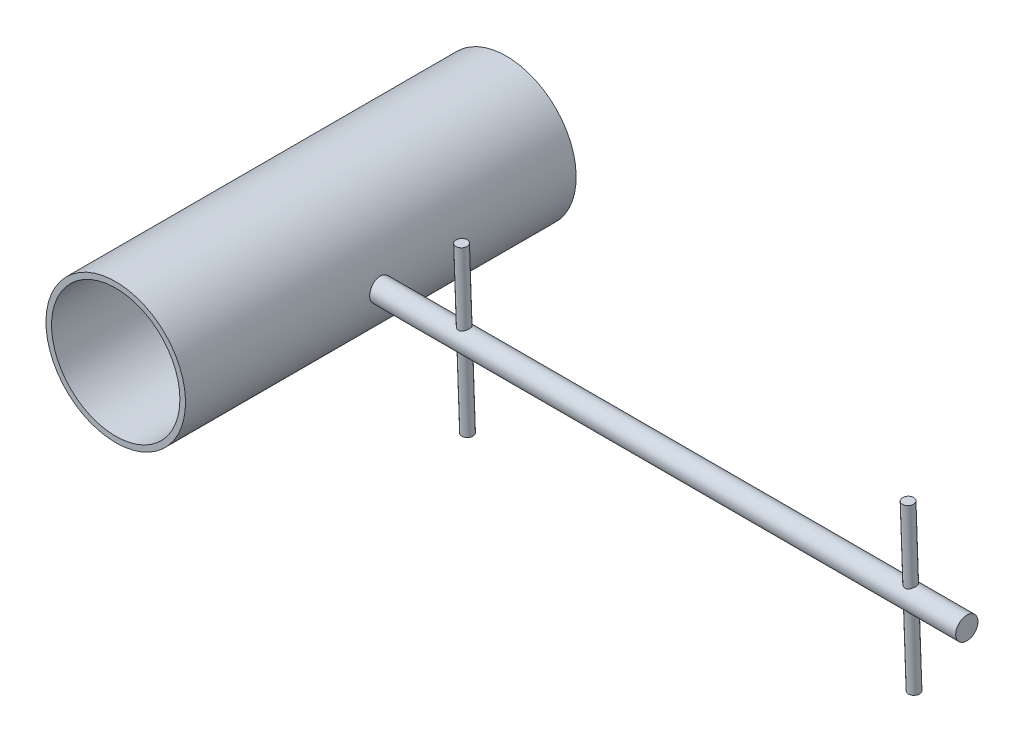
ISO-10303-21;
HEADER;
FILE_DESCRIPTION(('STEP AP214'),'2;1');
FILE_NAME('part.step','',(''),(''),'','','');
FILE_SCHEMA(('AUTOMOTIVE_DESIGN { 1 0 10303 214 1 1 1 1 }'));
ENDSEC;
DATA;
#1=APPLICATION_CONTEXT('core data for automotive mechanical design processes');
#2=APPLICATION_PROTOCOL_DEFINITION('international standard','automotive_design',2000,#1);
#3=PRODUCT_CONTEXT('',#1,'mechanical');
#4=PRODUCT('Part','Part','',(#3));
#5=PRODUCT_RELATED_PRODUCT_CATEGORY('part','',(#4));
#6=PRODUCT_DEFINITION_FORMATION('','',#4);
#7=PRODUCT_DEFINITION_CONTEXT('part definition',#1,'design');
#8=PRODUCT_DEFINITION('design','',#6,#7);
#9=PRODUCT_DEFINITION_SHAPE('','',#8);
#10=(LENGTH_UNIT() NAMED_UNIT(*) SI_UNIT(.MILLI.,.METRE.));
#11=(NAMED_UNIT(*) PLANE_ANGLE_UNIT() SI_UNIT($,.RADIAN.));
#12=(NAMED_UNIT(*) SI_UNIT($,.STERADIAN.) SOLID_ANGLE_UNIT());
#13=UNCERTAINTY_MEASURE_WITH_UNIT(LENGTH_MEASURE(1.E-05),#10,'distance_accuracy_value','');
#14=(GEOMETRIC_REPRESENTATION_CONTEXT(3) GLOBAL_UNCERTAINTY_ASSIGNED_CONTEXT((#13)) GLOBAL_UNIT_ASSIGNED_CONTEXT((#10,
#11,#12)) REPRESENTATION_CONTEXT('',''));
#15=CARTESIAN_POINT('',(0.,0.,0.));
#16=DIRECTION('',(0.,0.,1.));
#17=DIRECTION('',(1.,0.,0.));
#18=AXIS2_PLACEMENT_3D('',#15,#16,#17);
#19=CARTESIAN_POINT('',(0.,0.,-35.));
#20=DIRECTION('',(0.,0.,1.));
#21=DIRECTION('',(1.,0.,0.));
#22=AXIS2_PLACEMENT_3D('',#19,#20,#21);
#23=CYLINDRICAL_SURFACE('',#22,11.5);
#24=CARTESIAN_POINT('',(0.,0.,35.));
#25=DIRECTION('',(0.,0.,1.));
#26=DIRECTION('',(1.,0.,0.));
#27=AXIS2_PLACEMENT_3D('',#24,#25,#26);
#28=CIRCLE('',#27,11.5);
#29=CARTESIAN_POINT('',(11.5,0.,35.));
#30=VERTEX_POINT('',#29);
#31=EDGE_CURVE('E179',#30,#30,#28,.F.);
#32=ORIENTED_EDGE('',*,*,#31,.F.);
#33=EDGE_LOOP('',(#32));
#34=FACE_BOUND('',#33,.T.);
#35=CARTESIAN_POINT('',(0.,0.,-35.));
#36=DIRECTION('',(0.,0.,1.));
#37=DIRECTION('',(1.,0.,0.));
#38=AXIS2_PLACEMENT_3D('',#35,#36,#37);
#39=CIRCLE('',#38,11.5);
#40=CARTESIAN_POINT('',(11.5,0.,-35.));
#41=VERTEX_POINT('',#40);
#42=EDGE_CURVE('E20',#41,#41,#39,.T.);
#43=ORIENTED_EDGE('',*,*,#42,.F.);
#44=EDGE_LOOP('',(#43));
#45=FACE_BOUND('',#44,.T.);
#46=ADVANCED_FACE('F15',(#34,#45),#23,.F.);
#47=CARTESIAN_POINT('',(106.4,15.0296588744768,-0.565114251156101));
#48=DIRECTION('',(0.,0.999365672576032,0.035612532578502));
#49=DIRECTION('',(0.,-0.035612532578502,0.999365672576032));
#50=AXIS2_PLACEMENT_3D('',#47,#48,#49);
#51=PLANE('',#50);
#52=CARTESIAN_POINT('',(107.5,14.9904850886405,0.534187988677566));
#53=DIRECTION('',(0.,0.999365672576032,0.0356125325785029));
#54=DIRECTION('',(0.,-0.0356125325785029,0.999365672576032));
#55=AXIS2_PLACEMENT_3D('',#52,#53,#54);
#56=CIRCLE('',#55,1.00000000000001);
#57=CARTESIAN_POINT('',(107.5,14.954872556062,1.53355366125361));
#58=VERTEX_POINT('',#57);
#59=EDGE_CURVE('E182',#58,#58,#56,.F.);
#60=ORIENTED_EDGE('',*,*,#59,.F.);
#61=EDGE_LOOP('',(#60));
#62=FACE_BOUND('',#61,.T.);
#63=ADVANCED_FACE('F158',(#62),#51,.T.);
#64=CARTESIAN_POINT('',(26.4,15.0296588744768,-0.565114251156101));
#65=DIRECTION('',(0.,0.999365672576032,0.035612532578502));
#66=DIRECTION('',(0.,-0.035612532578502,0.999365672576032));
#67=AXIS2_PLACEMENT_3D('',#64,#65,#66);
#68=PLANE('',#67);
#69=CARTESIAN_POINT('',(27.5,14.9904850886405,0.534187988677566));
#70=DIRECTION('',(0.,0.999365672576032,0.0356125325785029));
#71=DIRECTION('',(0.,-0.0356125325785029,0.999365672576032));
#72=AXIS2_PLACEMENT_3D('',#69,#70,#71);
#73=CIRCLE('',#72,1.00000000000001);
#74=CARTESIAN_POINT('',(27.5,14.954872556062,1.53355366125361));
#75=VERTEX_POINT('',#74);
#76=EDGE_CURVE('E184',#75,#75,#73,.F.);
#77=ORIENTED_EDGE('',*,*,#76,.F.);
#78=EDGE_LOOP('',(#77));
#79=FACE_BOUND('',#78,.T.);
#80=ADVANCED_FACE('F150',(#79),#68,.T.);
#81=CARTESIAN_POINT('',(26.4,-15.0296588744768,0.56511425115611));
#82=DIRECTION('',(0.,-0.999365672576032,-0.035612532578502));
#83=DIRECTION('',(0.,0.035612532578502,-0.999365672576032));
#84=AXIS2_PLACEMENT_3D('',#81,#82,#83);
#85=PLANE('',#84);
#86=CARTESIAN_POINT('',(27.5,-14.9904850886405,-0.534187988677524));
#87=DIRECTION('',(0.,0.999365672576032,0.0356125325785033));
#88=DIRECTION('',(0.,-0.0356125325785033,0.999365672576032));
#89=AXIS2_PLACEMENT_3D('',#86,#87,#88);
#90=CIRCLE('',#89,1.00000000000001);
#91=CARTESIAN_POINT('',(27.5,-15.026097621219,0.465177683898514));
#92=VERTEX_POINT('',#91);
#93=EDGE_CURVE('E189',#92,#92,#90,.T.);
#94=ORIENTED_EDGE('',*,*,#93,.F.);
#95=EDGE_LOOP('',(#94));
#96=FACE_BOUND('',#95,.T.);
#97=ADVANCED_FACE('F142',(#96),#85,.T.);
#98=CARTESIAN_POINT('',(13.75,-13.75,-35.));
#99=DIRECTION('',(0.,0.,-1.));
#100=DIRECTION('',(-1.,0.,0.));
#101=AXIS2_PLACEMENT_3D('',#98,#99,#100);
#102=PLANE('',#101);
#103=ORIENTED_EDGE('',*,*,#42,.T.);
#104=EDGE_LOOP('',(#103));
#105=FACE_BOUND('',#104,.T.);
#106=CARTESIAN_POINT('',(0.,0.,-35.));
#107=DIRECTION('',(0.,0.,1.));
#108=DIRECTION('',(0.,-1.,0.));
#109=AXIS2_PLACEMENT_3D('',#106,#107,#108);
#110=CIRCLE('',#109,12.5);
#111=CARTESIAN_POINT('',(0.,-12.5,-35.));
#112=VERTEX_POINT('',#111);
#113=EDGE_CURVE('E192',#112,#112,#110,.T.);
#114=ORIENTED_EDGE('',*,*,#113,.F.);
#115=EDGE_LOOP('',(#114));
#116=FACE_BOUND('',#115,.T.);
#117=ADVANCED_FACE('F134',(#105,#116),#102,.T.);
#118=CARTESIAN_POINT('',(-13.75,-13.75,35.));
#119=DIRECTION('',(0.,0.,1.));
#120=DIRECTION('',(1.,0.,0.));
#121=AXIS2_PLACEMENT_3D('',#118,#119,#120);
#122=PLANE('',#121);
#123=ORIENTED_EDGE('',*,*,#31,.T.);
#124=EDGE_LOOP('',(#123));
#125=FACE_BOUND('',#124,.T.);
#126=CARTESIAN_POINT('',(0.,0.,35.));
#127=DIRECTION('',(0.,0.,1.));
#128=DIRECTION('',(0.,-1.,0.));
#129=AXIS2_PLACEMENT_3D('',#126,#127,#128);
#130=CIRCLE('',#129,12.5);
#131=CARTESIAN_POINT('',(0.,-12.5,35.));
#132=VERTEX_POINT('',#131);
#133=EDGE_CURVE('E195',#132,#132,#130,.F.);
#134=ORIENTED_EDGE('',*,*,#133,.F.);
#135=EDGE_LOOP('',(#134));
#136=FACE_BOUND('',#135,.T.);
#137=ADVANCED_FACE('F126',(#125,#136),#122,.T.);
#138=CARTESIAN_POINT('',(117.5,-2.2,2.2));
#139=DIRECTION('',(1.,0.,0.));
#140=DIRECTION('',(0.,0.,-1.));
#141=AXIS2_PLACEMENT_3D('',#138,#139,#140);
#142=PLANE('',#141);
#143=CARTESIAN_POINT('',(117.5,0.,0.));
#144=DIRECTION('',(-1.,0.,0.));
#145=DIRECTION('',(0.,0.,1.));
#146=AXIS2_PLACEMENT_3D('',#143,#144,#145);
#147=CIRCLE('',#146,2.);
#148=CARTESIAN_POINT('',(117.5,0.,2.00000000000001));
#149=VERTEX_POINT('',#148);
#150=EDGE_CURVE('E196',#149,#149,#147,.T.);
#151=ORIENTED_EDGE('',*,*,#150,.F.);
#152=EDGE_LOOP('',(#151));
#153=FACE_BOUND('',#152,.T.);
#154=ADVANCED_FACE('F119',(#153),#142,.T.);
#155=CARTESIAN_POINT('',(107.5,14.9904850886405,0.534187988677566));
#156=DIRECTION('',(0.,0.999365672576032,0.0356125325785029));
#157=DIRECTION('',(0.,-0.0356125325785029,0.999365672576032));
#158=AXIS2_PLACEMENT_3D('',#155,#156,#157);
#159=CYLINDRICAL_SURFACE('',#158,1.00000000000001);
#160=CARTESIAN_POINT('',(107.5,1.76656465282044,-0.93768295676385));
#161=CARTESIAN_POINT('',(107.552107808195,1.76656906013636,-0.93767916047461));
#162=CARTESIAN_POINT('',(107.604281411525,1.76880433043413,-0.933500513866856));
#163=CARTESIAN_POINT('',(107.707027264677,1.77740806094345,-0.917006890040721));
#164=CARTESIAN_POINT('',(107.757595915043,1.78378520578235,-0.904674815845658));
#165=CARTESIAN_POINT('',(107.855451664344,1.79970918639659,-0.872561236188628));
#166=CARTESIAN_POINT('',(107.902754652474,1.80923914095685,-0.852819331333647));
#167=CARTESIAN_POINT('',(107.993424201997,1.83031263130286,-0.806597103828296));
#168=CARTESIAN_POINT('',(108.036790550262,1.84185627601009,-0.780116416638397));
#169=CARTESIAN_POINT('',(108.122305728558,1.86674551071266,-0.718642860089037));
#170=CARTESIAN_POINT('',(108.164059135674,1.88016119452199,-0.683128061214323));
#171=CARTESIAN_POINT('',(108.241408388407,1.90650120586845,-0.60574271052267));
#172=CARTESIAN_POINT('',(108.277001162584,1.91942528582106,-0.563869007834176));
#173=CARTESIAN_POINT('',(108.343367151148,1.94424112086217,-0.471549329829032));
#174=CARTESIAN_POINT('',(108.37365376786,1.95600456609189,-0.420715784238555));
#175=CARTESIAN_POINT('',(108.425140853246,1.97594285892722,-0.313987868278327));
#176=CARTESIAN_POINT('',(108.446347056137,1.98411997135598,-0.258096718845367));
#177=CARTESIAN_POINT('',(108.477504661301,1.99530819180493,-0.14708026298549));
#178=CARTESIAN_POINT('',(108.488149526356,1.9986454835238,-0.0921834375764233));
#179=CARTESIAN_POINT('',(108.500166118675,2.0006793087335,0.0186904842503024));
#180=CARTESIAN_POINT('',(108.501543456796,1.99937865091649,0.0746669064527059));
#181=CARTESIAN_POINT('',(108.49525332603,1.99245125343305,0.180903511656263));
#182=CARTESIAN_POINT('',(108.488361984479,1.98721054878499,0.231237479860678));
#183=CARTESIAN_POINT('',(108.467119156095,1.97324929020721,0.329795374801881));
#184=CARTESIAN_POINT('',(108.452767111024,1.96452847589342,0.378019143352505));
#185=CARTESIAN_POINT('',(108.41691743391,1.94414547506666,0.471844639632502));
#186=CARTESIAN_POINT('',(108.395323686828,1.93244426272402,0.517400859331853));
#187=CARTESIAN_POINT('',(108.345736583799,1.90706638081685,0.604275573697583));
#188=CARTESIAN_POINT('',(108.317740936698,1.89338900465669,0.645592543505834));
#189=CARTESIAN_POINT('',(108.253104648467,1.86373559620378,0.727007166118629));
#190=CARTESIAN_POINT('',(108.215896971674,1.84766449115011,0.766620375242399));
#191=CARTESIAN_POINT('',(108.13541027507,1.81580554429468,0.839302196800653));
#192=CARTESIAN_POINT('',(108.092126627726,1.80001792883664,0.872365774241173));
#193=CARTESIAN_POINT('',(107.997351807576,1.76933357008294,0.933107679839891));
#194=CARTESIAN_POINT('',(107.945513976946,1.75455706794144,0.960310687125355));
#195=CARTESIAN_POINT('',(107.837062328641,1.7290417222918,1.00553250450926));
#196=CARTESIAN_POINT('',(107.780453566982,1.71829866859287,1.02356089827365));
#197=CARTESIAN_POINT('',(107.668785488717,1.70318699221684,1.04850010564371));
#198=CARTESIAN_POINT('',(107.613958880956,1.69838068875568,1.05617872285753));
#199=CARTESIAN_POINT('',(107.503598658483,1.69441450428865,1.06253333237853));
#200=CARTESIAN_POINT('',(107.44806557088,1.6952506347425,1.06121568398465));
#201=CARTESIAN_POINT('',(107.344346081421,1.70201860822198,1.05031548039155));
#202=CARTESIAN_POINT('',(107.296020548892,1.70738302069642,1.04165279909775));
#203=CARTESIAN_POINT('',(107.201632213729,1.7217909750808,1.0176591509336));
#204=CARTESIAN_POINT('',(107.155570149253,1.73083570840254,1.0023260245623));
#205=CARTESIAN_POINT('',(107.064588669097,1.75211976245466,0.964656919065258));
#206=CARTESIAN_POINT('',(107.019820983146,1.76448763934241,0.942029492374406));
#207=CARTESIAN_POINT('',(106.934530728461,1.79097955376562,0.89063333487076));
#208=CARTESIAN_POINT('',(106.894010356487,1.80510449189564,0.861861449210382));
#209=CARTESIAN_POINT('',(106.813021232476,1.83574257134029,0.794716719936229));
#210=CARTESIAN_POINT('',(106.773202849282,1.85233231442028,0.755590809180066));
#211=CARTESIAN_POINT('',(106.700587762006,1.88464370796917,0.670947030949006));
#212=CARTESIAN_POINT('',(106.667793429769,1.90036506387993,0.625427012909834));
#213=CARTESIAN_POINT('',(106.60942627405,1.92984871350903,0.527596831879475));
#214=CARTESIAN_POINT('',(106.584066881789,1.94354835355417,0.475139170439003));
#215=CARTESIAN_POINT('',(106.542862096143,1.96705402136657,0.365806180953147));
#216=CARTESIAN_POINT('',(106.527008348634,1.97686346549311,0.30893478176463));
#217=CARTESIAN_POINT('',(106.506631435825,1.99088646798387,0.198005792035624));
#218=CARTESIAN_POINT('',(106.501202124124,1.995530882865,0.144168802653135));
#219=CARTESIAN_POINT('',(106.499156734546,2.00040330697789,0.0361363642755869));
#220=CARTESIAN_POINT('',(106.502537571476,2.00063286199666,-0.0180589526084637));
#221=CARTESIAN_POINT('',(106.517416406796,1.99693329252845,-0.121499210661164));
#222=CARTESIAN_POINT('',(106.528364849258,1.99327720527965,-0.170835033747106));
#223=CARTESIAN_POINT('',(106.557326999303,1.98268739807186,-0.267006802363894));
#224=CARTESIAN_POINT('',(106.575341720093,1.97575320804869,-0.313842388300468));
#225=CARTESIAN_POINT('',(106.618727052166,1.95895767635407,-0.405917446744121));
#226=CARTESIAN_POINT('',(106.644379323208,1.94898382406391,-0.451002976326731));
#227=CARTESIAN_POINT('',(106.701957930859,1.92720930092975,-0.536482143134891));
#228=CARTESIAN_POINT('',(106.733887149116,1.91540779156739,-0.576873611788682));
#229=CARTESIAN_POINT('',(106.806797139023,1.88984769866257,-0.65602787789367));
#230=CARTESIAN_POINT('',(106.848362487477,1.87601123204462,-0.694228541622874));
#231=CARTESIAN_POINT('',(106.93745072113,1.84898668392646,-0.763300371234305));
#232=CARTESIAN_POINT('',(106.984978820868,1.83579918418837,-0.794165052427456));
#233=CARTESIAN_POINT('',(107.086636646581,1.81136093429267,-0.848462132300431));
#234=CARTESIAN_POINT('',(107.140927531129,1.80018455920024,-0.871628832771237));
#235=CARTESIAN_POINT('',(107.25333240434,1.78212778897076,-0.9079885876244));
#236=CARTESIAN_POINT('',(107.311432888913,1.77523303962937,-0.921214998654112));
#237=CARTESIAN_POINT('',(107.391805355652,1.76960390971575,-0.931938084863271));
#238=CARTESIAN_POINT('',(107.413367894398,1.76846835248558,-0.934088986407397));
#239=CARTESIAN_POINT('',(107.456616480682,1.76694778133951,-0.936962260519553));
#240=CARTESIAN_POINT('',(107.478302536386,1.76656281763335,-0.937684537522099));
#241=CARTESIAN_POINT('',(107.5,1.76656465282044,-0.93768295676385));
#242=B_SPLINE_CURVE_WITH_KNOTS('',3,(#160,#161,#162,#163,#164,#165,#166,#167,#168,#169,#170,
#171,#172,#173,#174,#175,#176,#177,#178,#179,#180,#181,#182,#183,#184,#185,#186,#187,#188,#189,
#190,#191,#192,#193,#194,#195,#196,#197,#198,#199,#200,#201,#202,#203,#204,#205,#206,#207,#208,
#209,#210,#211,#212,#213,#214,#215,#216,#217,#218,#219,#220,#221,#222,#223,#224,#225,#226,#227,
#228,#229,#230,#231,#232,#233,#234,#235,#236,#237,#238,#239,#240,#241),.UNSPECIFIED.,.T.,.F.,(4,
2,2,2,2,2,2,2,2,2,2,2,2,2,2,2,2,2,2,2,2,2,2,2,2,2,2,2,2,2,2,2,2,2,2,2,2,2,2,2,4),(0.,
0.15623212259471,0.312792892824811,0.468528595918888,0.624272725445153,0.792862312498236,
0.961535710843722,1.14157892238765,1.32150826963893,1.48863484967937,1.65566023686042,
1.8081609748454,1.96067312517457,2.11529534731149,2.26997299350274,2.43927191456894,
2.60870048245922,2.78888841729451,2.96888774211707,3.13462290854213,3.30024093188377,
3.44774183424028,3.59529052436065,3.74967296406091,3.90413486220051,4.07806743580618,
4.25205864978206,4.4306418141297,4.60906779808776,4.77112270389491,4.93312086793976,
5.08444424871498,5.23578933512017,5.39360750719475,5.55149830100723,5.72510241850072,
5.8988594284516,6.07810749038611,6.25675133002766,6.32180135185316,6.38685572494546),.UNSPECIFIED.);
#243=CARTESIAN_POINT('',(107.5,1.76656465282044,-0.93768295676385));
#244=VERTEX_POINT('',#243);
#245=EDGE_CURVE('E44',#244,#244,#242,.T.);
#246=ORIENTED_EDGE('',*,*,#245,.F.);
#247=EDGE_LOOP('',(#246));
#248=FACE_BOUND('',#247,.T.);
#249=ORIENTED_EDGE('',*,*,#59,.T.);
#250=EDGE_LOOP('',(#249));
#251=FACE_BOUND('',#250,.T.);
#252=ADVANCED_FACE('F112',(#248,#251),#159,.T.);
#253=CARTESIAN_POINT('',(27.5,14.9904850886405,0.534187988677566));
#254=DIRECTION('',(0.,0.999365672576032,0.0356125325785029));
#255=DIRECTION('',(0.,-0.0356125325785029,0.999365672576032));
#256=AXIS2_PLACEMENT_3D('',#253,#254,#255);
#257=CYLINDRICAL_SURFACE('',#256,1.00000000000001);
#258=CARTESIAN_POINT('',(27.5,1.76656465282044,-0.93768295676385));
#259=CARTESIAN_POINT('',(27.5521078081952,1.76656906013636,-0.93767916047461));
#260=CARTESIAN_POINT('',(27.604281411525,1.76880433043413,-0.933500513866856));
#261=CARTESIAN_POINT('',(27.7070272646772,1.77740806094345,-0.917006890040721));
#262=CARTESIAN_POINT('',(27.7575959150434,1.78378520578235,-0.904674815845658));
#263=CARTESIAN_POINT('',(27.8554516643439,1.79970918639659,-0.872561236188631));
#264=CARTESIAN_POINT('',(27.9027546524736,1.80923914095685,-0.852819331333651));
#265=CARTESIAN_POINT('',(27.9934242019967,1.83031263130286,-0.806597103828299));
#266=CARTESIAN_POINT('',(28.0367905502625,1.84185627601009,-0.780116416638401));
#267=CARTESIAN_POINT('',(28.1223057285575,1.86674551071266,-0.718642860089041));
#268=CARTESIAN_POINT('',(28.1640591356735,1.88016119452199,-0.683128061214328));
#269=CARTESIAN_POINT('',(28.2414083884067,1.90650120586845,-0.605742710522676));
#270=CARTESIAN_POINT('',(28.2770011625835,1.91942528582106,-0.563869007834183));
#271=CARTESIAN_POINT('',(28.3433671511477,1.94424112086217,-0.471549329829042));
#272=CARTESIAN_POINT('',(28.3736537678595,1.95600456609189,-0.420715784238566));
#273=CARTESIAN_POINT('',(28.4251408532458,1.97594285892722,-0.313987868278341));
#274=CARTESIAN_POINT('',(28.4463470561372,1.98411997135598,-0.258096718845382));
#275=CARTESIAN_POINT('',(28.4775046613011,1.99530819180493,-0.147080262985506));
#276=CARTESIAN_POINT('',(28.4881495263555,1.9986454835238,-0.0921834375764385));
#277=CARTESIAN_POINT('',(28.5001661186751,2.00067930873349,0.0186904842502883));
#278=CARTESIAN_POINT('',(28.5015434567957,1.99937865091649,0.0746669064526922));
#279=CARTESIAN_POINT('',(28.4952533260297,1.99245125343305,0.180903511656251));
#280=CARTESIAN_POINT('',(28.4883619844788,1.98721054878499,0.231237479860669));
#281=CARTESIAN_POINT('',(28.4671191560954,1.97324929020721,0.329795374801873));
#282=CARTESIAN_POINT('',(28.4527671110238,1.96452847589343,0.378019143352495));
#283=CARTESIAN_POINT('',(28.4169174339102,1.94414547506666,0.471844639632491));
#284=CARTESIAN_POINT('',(28.395323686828,1.93244426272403,0.517400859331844));
#285=CARTESIAN_POINT('',(28.3457365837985,1.90706638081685,0.604275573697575));
#286=CARTESIAN_POINT('',(28.3177409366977,1.89338900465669,0.645592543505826));
#287=CARTESIAN_POINT('',(28.253104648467,1.86373559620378,0.72700716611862));
#288=CARTESIAN_POINT('',(28.215896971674,1.84766449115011,0.766620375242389));
#289=CARTESIAN_POINT('',(28.1354102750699,1.81580554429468,0.839302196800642));
#290=CARTESIAN_POINT('',(28.092126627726,1.80001792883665,0.872365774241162));
#291=CARTESIAN_POINT('',(27.9973518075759,1.76933357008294,0.933107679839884));
#292=CARTESIAN_POINT('',(27.9455139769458,1.75455706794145,0.96031068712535));
#293=CARTESIAN_POINT('',(27.837062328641,1.72904172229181,1.00553250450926));
#294=CARTESIAN_POINT('',(27.7804535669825,1.71829866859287,1.02356089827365));
#295=CARTESIAN_POINT('',(27.6687854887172,1.70318699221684,1.04850010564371));
#296=CARTESIAN_POINT('',(27.6139588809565,1.69838068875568,1.05617872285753));
#297=CARTESIAN_POINT('',(27.5035986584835,1.69441450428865,1.06253333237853));
#298=CARTESIAN_POINT('',(27.4480655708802,1.6952506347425,1.06121568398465));
#299=CARTESIAN_POINT('',(27.3443460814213,1.70201860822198,1.05031548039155));
#300=CARTESIAN_POINT('',(27.2960205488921,1.70738302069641,1.04165279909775));
#301=CARTESIAN_POINT('',(27.2016322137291,1.7217909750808,1.0176591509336));
#302=CARTESIAN_POINT('',(27.1555701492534,1.73083570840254,1.00232602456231));
#303=CARTESIAN_POINT('',(27.0645886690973,1.75211976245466,0.964656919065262));
#304=CARTESIAN_POINT('',(27.0198209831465,1.76448763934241,0.942029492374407));
#305=CARTESIAN_POINT('',(26.934530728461,1.79097955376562,0.890633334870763));
#306=CARTESIAN_POINT('',(26.8940103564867,1.80510449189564,0.861861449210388));
#307=CARTESIAN_POINT('',(26.8130212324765,1.83574257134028,0.79471671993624));
#308=CARTESIAN_POINT('',(26.7732028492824,1.85233231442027,0.755590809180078));
#309=CARTESIAN_POINT('',(26.7005877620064,1.88464370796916,0.670947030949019));
#310=CARTESIAN_POINT('',(26.6677934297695,1.90036506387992,0.625427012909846));
#311=CARTESIAN_POINT('',(26.6094262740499,1.92984871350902,0.527596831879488));
#312=CARTESIAN_POINT('',(26.5840668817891,1.94354835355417,0.475139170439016));
#313=CARTESIAN_POINT('',(26.5428620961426,1.96705402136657,0.365806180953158));
#314=CARTESIAN_POINT('',(26.5270083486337,1.9768634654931,0.30893478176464));
#315=CARTESIAN_POINT('',(26.5066314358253,1.99088646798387,0.198005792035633));
#316=CARTESIAN_POINT('',(26.5012021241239,1.995530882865,0.144168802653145));
#317=CARTESIAN_POINT('',(26.4991567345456,2.00040330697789,0.0361363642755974));
#318=CARTESIAN_POINT('',(26.5025375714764,2.00063286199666,-0.0180589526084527));
#319=CARTESIAN_POINT('',(26.5174164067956,1.99693329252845,-0.121499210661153));
#320=CARTESIAN_POINT('',(26.5283648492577,1.99327720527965,-0.170835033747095));
#321=CARTESIAN_POINT('',(26.557326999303,1.98268739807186,-0.267006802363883));
#322=CARTESIAN_POINT('',(26.5753417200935,1.97575320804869,-0.313842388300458));
#323=CARTESIAN_POINT('',(26.618727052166,1.95895767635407,-0.405917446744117));
#324=CARTESIAN_POINT('',(26.6443793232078,1.94898382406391,-0.451002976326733));
#325=CARTESIAN_POINT('',(26.701957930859,1.92720930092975,-0.536482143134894));
#326=CARTESIAN_POINT('',(26.7338871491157,1.91540779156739,-0.576873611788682));
#327=CARTESIAN_POINT('',(26.8067971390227,1.88984769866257,-0.656027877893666));
#328=CARTESIAN_POINT('',(26.8483624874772,1.87601123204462,-0.694228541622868));
#329=CARTESIAN_POINT('',(26.9374507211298,1.84898668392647,-0.763300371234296));
#330=CARTESIAN_POINT('',(26.9849788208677,1.83579918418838,-0.794165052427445));
#331=CARTESIAN_POINT('',(27.0866366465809,1.81136093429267,-0.848462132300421));
#332=CARTESIAN_POINT('',(27.1409275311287,1.80018455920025,-0.871628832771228));
#333=CARTESIAN_POINT('',(27.2533324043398,1.78212778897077,-0.907988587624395));
#334=CARTESIAN_POINT('',(27.3114328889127,1.77523303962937,-0.92121499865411));
#335=CARTESIAN_POINT('',(27.391805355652,1.76960390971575,-0.931938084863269));
#336=CARTESIAN_POINT('',(27.4133678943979,1.76846835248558,-0.934088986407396));
#337=CARTESIAN_POINT('',(27.4566164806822,1.76694778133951,-0.936962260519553));
#338=CARTESIAN_POINT('',(27.4783025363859,1.76656281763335,-0.937684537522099));
#339=CARTESIAN_POINT('',(27.5,1.76656465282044,-0.93768295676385));
#340=B_SPLINE_CURVE_WITH_KNOTS('',3,(#258,#259,#260,#261,#262,#263,#264,#265,#266,#267,#268,
#269,#270,#271,#272,#273,#274,#275,#276,#277,#278,#279,#280,#281,#282,#283,#284,#285,#286,#287,
#288,#289,#290,#291,#292,#293,#294,#295,#296,#297,#298,#299,#300,#301,#302,#303,#304,#305,#306,
#307,#308,#309,#310,#311,#312,#313,#314,#315,#316,#317,#318,#319,#320,#321,#322,#323,#324,#325,
#326,#327,#328,#329,#330,#331,#332,#333,#334,#335,#336,#337,#338,#339),.UNSPECIFIED.,.T.,.F.,(4,
2,2,2,2,2,2,2,2,2,2,2,2,2,2,2,2,2,2,2,2,2,2,2,2,2,2,2,2,2,2,2,2,2,2,2,2,2,2,2,4),(0.,
0.156232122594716,0.312792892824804,0.468528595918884,0.624272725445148,0.79286231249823,
0.961535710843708,1.14157892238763,1.32150826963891,1.48863484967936,1.6556602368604,
1.80816097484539,1.96067312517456,2.11529534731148,2.26997299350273,2.43927191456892,
2.6087004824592,2.7888884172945,2.96888774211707,3.13462290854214,3.30024093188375,
3.44774183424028,3.59529052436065,3.7496729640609,3.90413486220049,4.07806743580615,
4.25205864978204,4.43064181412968,4.60906779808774,4.7711227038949,4.93312086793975,
5.08444424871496,5.23578933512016,5.39360750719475,5.55149830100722,5.72510241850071,
5.89885942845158,6.07810749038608,6.25675133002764,6.32180135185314,6.38685572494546),.UNSPECIFIED.);
#341=CARTESIAN_POINT('',(27.5,1.76656465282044,-0.93768295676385));
#342=VERTEX_POINT('',#341);
#343=EDGE_CURVE('E60',#342,#342,#340,.T.);
#344=ORIENTED_EDGE('',*,*,#343,.F.);
#345=EDGE_LOOP('',(#344));
#346=FACE_BOUND('',#345,.T.);
#347=ORIENTED_EDGE('',*,*,#76,.T.);
#348=EDGE_LOOP('',(#347));
#349=FACE_BOUND('',#348,.T.);
#350=ADVANCED_FACE('F68',(#346,#349),#257,.T.);
#351=CARTESIAN_POINT('',(27.5,-1.65139220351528,-0.0588475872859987));
#352=DIRECTION('',(0.,0.999365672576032,0.0356125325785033));
#353=DIRECTION('',(0.,-0.0356125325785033,0.999365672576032));
#354=AXIS2_PLACEMENT_3D('',#351,#352,#353);
#355=CYLINDRICAL_SURFACE('',#354,1.00000000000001);
#356=CARTESIAN_POINT('',(27.5,-1.69533958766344,-1.06104838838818));
#357=CARTESIAN_POINT('',(27.4478921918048,-1.69534425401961,-1.06104491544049));
#358=CARTESIAN_POINT('',(27.395718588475,-1.6978712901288,-1.05703597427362));
#359=CARTESIAN_POINT('',(27.2929727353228,-1.70762721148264,-1.04119659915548));
#360=CARTESIAN_POINT('',(27.2424040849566,-1.71486597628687,-1.02934972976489));
#361=CARTESIAN_POINT('',(27.1445483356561,-1.73303540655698,-0.998451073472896));
#362=CARTESIAN_POINT('',(27.0972453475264,-1.74394641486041,-0.979437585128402));
#363=CARTESIAN_POINT('',(27.0065757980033,-1.76825654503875,-0.934832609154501));
#364=CARTESIAN_POINT('',(26.9632094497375,-1.78165580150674,-0.909240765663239));
#365=CARTESIAN_POINT('',(26.8776942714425,-1.81085758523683,-0.849694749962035));
#366=CARTESIAN_POINT('',(26.8359408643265,-1.82676717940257,-0.815224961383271));
#367=CARTESIAN_POINT('',(26.7585916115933,-1.85854865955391,-0.739910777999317));
#368=CARTESIAN_POINT('',(26.7229988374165,-1.87442052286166,-0.699063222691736));
#369=CARTESIAN_POINT('',(26.6566328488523,-1.90574471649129,-0.608744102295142));
#370=CARTESIAN_POINT('',(26.6263462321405,-1.92109664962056,-0.558876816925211));
#371=CARTESIAN_POINT('',(26.5748591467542,-1.94858124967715,-0.453838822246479));
#372=CARTESIAN_POINT('',(26.5536529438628,-1.96071594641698,-0.398671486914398));
#373=CARTESIAN_POINT('',(26.5224953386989,-1.97977792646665,-0.288733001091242));
#374=CARTESIAN_POINT('',(26.5118504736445,-1.98701430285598,-0.23421296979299));
#375=CARTESIAN_POINT('',(26.499833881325,-1.99693496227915,-0.123765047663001));
#376=CARTESIAN_POINT('',(26.4984565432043,-1.99962199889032,-0.0678380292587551));
#377=CARTESIAN_POINT('',(26.5047466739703,-2.00027408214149,0.0386221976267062));
#378=CARTESIAN_POINT('',(26.5116380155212,-1.9986294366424,0.089201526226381));
#379=CARTESIAN_POINT('',(26.5328808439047,-1.9917189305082,0.188503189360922));
#380=CARTESIAN_POINT('',(26.5472328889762,-1.9864527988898,0.237225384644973));
#381=CARTESIAN_POINT('',(26.5830825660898,-1.97279998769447,0.332263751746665));
#382=CARTESIAN_POINT('',(26.6046763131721,-1.96437114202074,0.378537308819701));
#383=CARTESIAN_POINT('',(26.6542634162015,-1.94524136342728,0.466998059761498));
#384=CARTESIAN_POINT('',(26.6822590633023,-1.93453961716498,0.509183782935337));
#385=CARTESIAN_POINT('',(26.746895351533,-1.91075650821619,0.592502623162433));
#386=CARTESIAN_POINT('',(26.784103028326,-1.89754583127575,0.633159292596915));
#387=CARTESIAN_POINT('',(26.8645897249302,-1.87094117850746,0.707924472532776));
#388=CARTESIAN_POINT('',(26.9078733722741,-1.85754707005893,0.742027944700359));
#389=CARTESIAN_POINT('',(27.0026481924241,-1.83126414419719,0.804799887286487));
#390=CARTESIAN_POINT('',(27.0544860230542,-1.81846142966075,0.832985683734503));
#391=CARTESIAN_POINT('',(27.162937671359,-1.79622968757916,0.879908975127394));
#392=CARTESIAN_POINT('',(27.2195464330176,-1.78679714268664,0.898656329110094));
#393=CARTESIAN_POINT('',(27.3312145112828,-1.7734989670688,0.924607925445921));
#394=CARTESIAN_POINT('',(27.3860411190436,-1.76925141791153,0.93260917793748));
#395=CARTESIAN_POINT('',(27.4964013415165,-1.76574761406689,0.939229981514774));
#396=CARTESIAN_POINT('',(27.5519344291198,-1.76648783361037,0.937856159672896));
#397=CARTESIAN_POINT('',(27.6556539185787,-1.77246276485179,0.926501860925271));
#398=CARTESIAN_POINT('',(27.7039794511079,-1.77719696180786,0.917479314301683));
#399=CARTESIAN_POINT('',(27.798367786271,-1.78986050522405,0.892520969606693));
#400=CARTESIAN_POINT('',(27.8444298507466,-1.7977908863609,0.876582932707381));
#401=CARTESIAN_POINT('',(27.9354113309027,-1.81633967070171,0.837494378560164));
#402=CARTESIAN_POINT('',(27.9801790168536,-1.82706555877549,0.814044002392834));
#403=CARTESIAN_POINT('',(28.065469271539,-1.84983190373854,0.760892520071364));
#404=CARTESIAN_POINT('',(28.1059896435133,-1.86187303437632,0.731188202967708));
#405=CARTESIAN_POINT('',(28.1869787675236,-1.88765404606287,0.66203297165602));
#406=CARTESIAN_POINT('',(28.2267971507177,-1.90141673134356,0.621825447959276));
#407=CARTESIAN_POINT('',(28.2994122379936,-1.92762123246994,0.535096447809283));
#408=CARTESIAN_POINT('',(28.3322065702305,-1.94006260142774,0.488572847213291));
#409=CARTESIAN_POINT('',(28.3905737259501,-1.96250792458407,0.388892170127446));
#410=CARTESIAN_POINT('',(28.4159331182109,-1.97243888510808,0.335592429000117));
#411=CARTESIAN_POINT('',(28.4571379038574,-1.98810262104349,0.224863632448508));
#412=CARTESIAN_POINT('',(28.4729916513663,-1.99383908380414,0.167438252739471));
#413=CARTESIAN_POINT('',(28.4933685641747,-1.99993060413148,0.0557924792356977));
#414=CARTESIAN_POINT('',(28.4987978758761,-2.00073112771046,0.0017614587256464));
#415=CARTESIAN_POINT('',(28.5008432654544,-1.99790145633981,-0.10634377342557));
#416=CARTESIAN_POINT('',(28.4974624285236,-1.99427281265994,-0.160417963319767));
#417=CARTESIAN_POINT('',(28.4825835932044,-1.98321976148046,-0.263332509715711));
#418=CARTESIAN_POINT('',(28.4716351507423,-1.97606122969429,-0.31228295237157));
#419=CARTESIAN_POINT('',(28.442673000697,-1.95865278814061,-0.407456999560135));
#420=CARTESIAN_POINT('',(28.4246582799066,-1.94840243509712,-0.453680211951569));
#421=CARTESIAN_POINT('',(28.381272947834,-1.92509561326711,-0.544326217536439));
#422=CARTESIAN_POINT('',(28.3556206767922,-1.9119378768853,-0.588587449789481));
#423=CARTESIAN_POINT('',(28.298042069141,-1.88413418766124,-0.672299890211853));
#424=CARTESIAN_POINT('',(28.2661128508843,-1.86948755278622,-0.711748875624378));
#425=CARTESIAN_POINT('',(28.1932028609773,-1.83835810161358,-0.78888300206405));
#426=CARTESIAN_POINT('',(28.1516375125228,-1.82183761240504,-0.826001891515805));
#427=CARTESIAN_POINT('',(28.0625492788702,-1.78996508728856,-0.892974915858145));
#428=CARTESIAN_POINT('',(28.0150211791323,-1.77461409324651,-0.922822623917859));
#429=CARTESIAN_POINT('',(27.9133633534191,-1.74637297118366,-0.975242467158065));
#430=CARTESIAN_POINT('',(27.8590724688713,-1.73357594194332,-0.997554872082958));
#431=CARTESIAN_POINT('',(27.7466675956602,-1.71297688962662,-1.03253712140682));
#432=CARTESIAN_POINT('',(27.6885671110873,-1.70515817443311,-1.04523921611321));
#433=CARTESIAN_POINT('',(27.608194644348,-1.69878005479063,-1.05553442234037));
#434=CARTESIAN_POINT('',(27.5866321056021,-1.69749427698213,-1.05759903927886));
#435=CARTESIAN_POINT('',(27.5433835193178,-1.69577304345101,-1.06035679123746));
#436=CARTESIAN_POINT('',(27.5216974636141,-1.69533764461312,-1.06104983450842));
#437=CARTESIAN_POINT('',(27.5,-1.69533958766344,-1.06104838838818));
#438=B_SPLINE_CURVE_WITH_KNOTS('',3,(#356,#357,#358,#359,#360,#361,#362,#363,#364,#365,#366,
#367,#368,#369,#370,#371,#372,#373,#374,#375,#376,#377,#378,#379,#380,#381,#382,#383,#384,#385,
#386,#387,#388,#389,#390,#391,#392,#393,#394,#395,#396,#397,#398,#399,#400,#401,#402,#403,#404,
#405,#406,#407,#408,#409,#410,#411,#412,#413,#414,#415,#416,#417,#418,#419,#420,#421,#422,#423,
#424,#425,#426,#427,#428,#429,#430,#431,#432,#433,#434,#435,#436,#437),.UNSPECIFIED.,.T.,.F.,(4,
2,2,2,2,2,2,2,2,2,2,2,2,2,2,2,2,2,2,2,2,2,2,2,2,2,2,2,2,2,2,2,2,2,2,2,2,2,2,2,4),(0.,
0.156232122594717,0.312792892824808,0.46852859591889,0.624272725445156,0.792862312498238,
0.961535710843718,1.14157892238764,1.32150826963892,1.48863484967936,1.65566023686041,
1.80816097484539,1.96067312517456,2.11529534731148,2.26997299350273,2.43927191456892,
2.6087004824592,2.7888884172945,2.96888774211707,3.13462290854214,3.30024093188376,
3.44774183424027,3.59529052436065,3.7496729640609,3.9041348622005,4.07806743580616,
4.25205864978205,4.43064181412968,4.60906779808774,4.7711227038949,4.93312086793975,
5.08444424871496,5.23578933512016,5.39360750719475,5.55149830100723,5.72510241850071,
5.89885942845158,6.07810749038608,6.25675133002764,6.32180135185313,6.38685572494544),.UNSPECIFIED.);
#439=CARTESIAN_POINT('',(27.5,-1.69533958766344,-1.06104838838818));
#440=VERTEX_POINT('',#439);
#441=EDGE_CURVE('E55',#440,#440,#438,.T.);
#442=ORIENTED_EDGE('',*,*,#441,.F.);
#443=EDGE_LOOP('',(#442));
#444=FACE_BOUND('',#443,.T.);
#445=ORIENTED_EDGE('',*,*,#93,.T.);
#446=EDGE_LOOP('',(#445));
#447=FACE_BOUND('',#446,.T.);
#448=ADVANCED_FACE('F64',(#444,#447),#355,.T.);
#449=CARTESIAN_POINT('',(0.,0.,35.));
#450=DIRECTION('',(0.,0.,1.));
#451=DIRECTION('',(0.,-1.,0.));
#452=AXIS2_PLACEMENT_3D('',#449,#450,#451);
#453=CYLINDRICAL_SURFACE('',#452,12.5);
#454=ORIENTED_EDGE('',*,*,#133,.T.);
#455=EDGE_LOOP('',(#454));
#456=FACE_BOUND('',#455,.T.);
#457=CARTESIAN_POINT('',(12.3389626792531,-2.,0.));
#458=CARTESIAN_POINT('',(12.3389646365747,-1.99999546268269,-0.111566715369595));
#459=CARTESIAN_POINT('',(12.3404922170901,-1.99063305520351,-0.223195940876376));
#460=CARTESIAN_POINT('',(12.3464325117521,-1.95344445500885,-0.443326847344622));
#461=CARTESIAN_POINT('',(12.3508479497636,-1.92560083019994,-0.55182547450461));
#462=CARTESIAN_POINT('',(12.3620513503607,-1.85230972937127,-0.762477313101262));
#463=CARTESIAN_POINT('',(12.3688373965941,-1.8068764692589,-0.864635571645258));
#464=CARTESIAN_POINT('',(12.3840151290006,-1.69973041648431,-1.05986648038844));
#465=CARTESIAN_POINT('',(12.3924066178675,-1.63801962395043,-1.15294024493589));
#466=CARTESIAN_POINT('',(12.409935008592,-1.4994714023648,-1.32821893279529));
#467=CARTESIAN_POINT('',(12.4190774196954,-1.42251498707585,-1.41032926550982));
#468=CARTESIAN_POINT('',(12.4370285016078,-1.25591709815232,-1.56052945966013));
#469=CARTESIAN_POINT('',(12.4458371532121,-1.16627489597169,-1.62861851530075));
#470=CARTESIAN_POINT('',(12.4621862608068,-0.976239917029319,-1.74919596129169));
#471=CARTESIAN_POINT('',(12.4697194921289,-0.875790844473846,-1.8015966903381));
#472=CARTESIAN_POINT('',(12.4826077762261,-0.66737599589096,-1.88874693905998));
#473=CARTESIAN_POINT('',(12.4879629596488,-0.559410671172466,-1.92349751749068));
#474=CARTESIAN_POINT('',(12.4958528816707,-0.340004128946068,-1.97407274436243));
#475=CARTESIAN_POINT('',(12.49841126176,-0.228600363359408,-1.9900561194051));
#476=CARTESIAN_POINT('',(12.500500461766,-0.00466480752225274,-2.0031365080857));
#477=CARTESIAN_POINT('',(12.5000314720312,0.10786691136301,-2.00023470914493));
#478=CARTESIAN_POINT('',(12.4961375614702,0.32977971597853,-1.97575151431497));
#479=CARTESIAN_POINT('',(12.4927396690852,0.439180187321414,-1.95434091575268));
#480=CARTESIAN_POINT('',(12.4833998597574,0.652815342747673,-1.89371648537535));
#481=CARTESIAN_POINT('',(12.4774578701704,0.757049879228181,-1.85450214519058));
#482=CARTESIAN_POINT('',(12.4636513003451,0.957905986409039,-1.75921154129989));
#483=CARTESIAN_POINT('',(12.4557786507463,1.05449329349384,-1.70306427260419));
#484=CARTESIAN_POINT('',(12.4389865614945,1.23693967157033,-1.575553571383));
#485=CARTESIAN_POINT('',(12.4300670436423,1.32279794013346,-1.50418900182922));
#486=CARTESIAN_POINT('',(12.4120565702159,1.48235721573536,-1.34732043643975));
#487=CARTESIAN_POINT('',(12.4029648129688,1.555911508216,-1.2616672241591));
#488=CARTESIAN_POINT('',(12.3857313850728,1.68762680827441,-1.07915724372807));
#489=CARTESIAN_POINT('',(12.3775897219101,1.74578769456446,-0.982300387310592));
#490=CARTESIAN_POINT('',(12.3631781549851,1.84509031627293,-0.779969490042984));
#491=CARTESIAN_POINT('',(12.3569100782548,1.88621545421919,-0.674487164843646));
#492=CARTESIAN_POINT('',(12.3469864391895,1.95012354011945,-0.457989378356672));
#493=CARTESIAN_POINT('',(12.343330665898,1.97290796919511,-0.346974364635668));
#494=CARTESIAN_POINT('',(12.3390860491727,1.99928349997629,-0.12387217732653));
#495=CARTESIAN_POINT('',(12.338463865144,2.00308326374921,-0.0118102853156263));
#496=CARTESIAN_POINT('',(12.3402681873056,1.99193667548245,0.21134896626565));
#497=CARTESIAN_POINT('',(12.3426945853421,1.97699098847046,0.322446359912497));
#498=CARTESIAN_POINT('',(12.3502919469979,1.92895527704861,0.539866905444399));
#499=CARTESIAN_POINT('',(12.3554469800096,1.89597053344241,0.646213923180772));
#500=CARTESIAN_POINT('',(12.3679074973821,1.81290306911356,0.851870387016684));
#501=CARTESIAN_POINT('',(12.3752131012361,1.76281939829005,0.951179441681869));
#502=CARTESIAN_POINT('',(12.3912295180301,1.64647965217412,1.14087239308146));
#503=CARTESIAN_POINT('',(12.3999517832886,1.58008930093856,1.23117295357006));
#504=CARTESIAN_POINT('',(12.4177848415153,1.43320604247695,1.39942606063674));
#505=CARTESIAN_POINT('',(12.426895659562,1.35271222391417,1.47737780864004));
#506=CARTESIAN_POINT('',(12.4445842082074,1.17898475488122,1.61947729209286));
#507=CARTESIAN_POINT('',(12.4531560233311,1.085636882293,1.68348622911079));
#508=CARTESIAN_POINT('',(12.4687070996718,0.88939184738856,1.7949130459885));
#509=CARTESIAN_POINT('',(12.4756864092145,0.786494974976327,1.8423314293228));
#510=CARTESIAN_POINT('',(12.4872402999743,0.574493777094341,1.9190127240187));
#511=CARTESIAN_POINT('',(12.491824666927,0.465416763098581,1.948349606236));
#512=CARTESIAN_POINT('',(12.4981133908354,0.243805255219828,1.98827383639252));
#513=CARTESIAN_POINT('',(12.4998179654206,0.131271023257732,1.99886260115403));
#514=CARTESIAN_POINT('',(12.5001523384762,-0.09271816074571,2.00095179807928));
#515=CARTESIAN_POINT('',(12.4988162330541,-0.204171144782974,1.99266389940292));
#516=CARTESIAN_POINT('',(12.4932886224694,-0.424076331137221,1.95769116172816));
#517=CARTESIAN_POINT('',(12.4890971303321,-0.532528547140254,1.93100640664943));
#518=CARTESIAN_POINT('',(12.4783277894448,-0.743282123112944,1.86007617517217));
#519=CARTESIAN_POINT('',(12.471752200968,-0.845589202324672,1.81584732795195));
#520=CARTESIAN_POINT('',(12.4569342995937,-1.04136319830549,1.71110753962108));
#521=CARTESIAN_POINT('',(12.4486919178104,-1.13482974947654,1.65059592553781));
#522=CARTESIAN_POINT('',(12.4313454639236,-1.31133889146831,1.51425167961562));
#523=CARTESIAN_POINT('',(12.4222331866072,-1.39426053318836,1.43826349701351));
#524=CARTESIAN_POINT('',(12.4042323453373,-1.54625119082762,1.27345013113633));
#525=CARTESIAN_POINT('',(12.3953438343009,-1.61531695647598,1.1846219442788));
#526=CARTESIAN_POINT('',(12.3787350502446,-1.73804191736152,0.995970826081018));
#527=CARTESIAN_POINT('',(12.3710226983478,-1.79159866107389,0.896080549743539));
#528=CARTESIAN_POINT('',(12.35773272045,-1.88109182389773,0.688641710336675));
#529=CARTESIAN_POINT('',(12.3521529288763,-1.91704612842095,0.581101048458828));
#530=CARTESIAN_POINT('',(12.3450187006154,-1.96235985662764,0.394262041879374));
#531=CARTESIAN_POINT('',(12.3427600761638,-1.97645270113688,0.316104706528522));
#532=CARTESIAN_POINT('',(12.339731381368,-1.99527431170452,0.158642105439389));
#533=CARTESIAN_POINT('',(12.3389612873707,-2.00000322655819,0.0793368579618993));
#534=CARTESIAN_POINT('',(12.3389626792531,-2.,0.));
#535=B_SPLINE_CURVE_WITH_KNOTS('',3,(#457,#458,#459,#460,#461,#462,#463,#464,#465,#466,#467,
#468,#469,#470,#471,#472,#473,#474,#475,#476,#477,#478,#479,#480,#481,#482,#483,#484,#485,#486,
#487,#488,#489,#490,#491,#492,#493,#494,#495,#496,#497,#498,#499,#500,#501,#502,#503,#504,#505,
#506,#507,#508,#509,#510,#511,#512,#513,#514,#515,#516,#517,#518,#519,#520,#521,#522,#523,#524,
#525,#526,#527,#528,#529,#530,#531,#532,#533,#534),.UNSPECIFIED.,.T.,.F.,(4,2,2,2,2,2,2,2,2,2,2,
2,2,2,2,2,2,2,2,2,2,2,2,2,2,2,2,2,2,2,2,2,2,2,2,2,2,2,4),(0.,0.334410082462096,0.66913604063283,
1.00359203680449,1.33800695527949,1.6751426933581,2.01229780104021,2.35130309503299,
2.69028805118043,3.02638485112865,3.36246051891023,3.69546762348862,4.0284842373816,
4.36291718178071,4.69737512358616,5.03557384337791,5.37377522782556,5.71230534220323,
6.05080811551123,6.3855820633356,6.72034413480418,7.05317297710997,7.38602031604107,
7.72170617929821,8.05741374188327,8.39632425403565,8.73522448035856,9.07272891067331,
9.41020783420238,9.74392117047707,10.0776329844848,10.4110292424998,10.7444392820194,
11.0813822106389,11.4184040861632,11.7576040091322,12.0964585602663,12.3342666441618,
12.5720709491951),.UNSPECIFIED.);
#536=CARTESIAN_POINT('',(12.3389626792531,-2.,0.));
#537=VERTEX_POINT('',#536);
#538=EDGE_CURVE('E29',#537,#537,#535,.T.);
#539=ORIENTED_EDGE('',*,*,#538,.F.);
#540=EDGE_LOOP('',(#539));
#541=FACE_BOUND('',#540,.T.);
#542=ORIENTED_EDGE('',*,*,#113,.T.);
#543=EDGE_LOOP('',(#542));
#544=FACE_BOUND('',#543,.T.);
#545=ADVANCED_FACE('F67',(#456,#541,#544),#453,.T.);
#546=CARTESIAN_POINT('',(106.4,-15.0296588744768,0.56511425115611));
#547=DIRECTION('',(0.,-0.999365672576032,-0.035612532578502));
#548=DIRECTION('',(0.,0.035612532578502,-0.999365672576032));
#549=AXIS2_PLACEMENT_3D('',#546,#547,#548);
#550=PLANE('',#549);
#551=CARTESIAN_POINT('',(107.5,-14.9904850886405,-0.534187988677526));
#552=DIRECTION('',(0.,0.999365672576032,0.0356125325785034));
#553=DIRECTION('',(0.,-0.0356125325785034,0.999365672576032));
#554=AXIS2_PLACEMENT_3D('',#551,#552,#553);
#555=CIRCLE('',#554,1.00000000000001);
#556=CARTESIAN_POINT('',(107.5,-15.026097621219,0.465177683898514));
#557=VERTEX_POINT('',#556);
#558=EDGE_CURVE('E24',#557,#557,#555,.T.);
#559=ORIENTED_EDGE('',*,*,#558,.F.);
#560=EDGE_LOOP('',(#559));
#561=FACE_BOUND('',#560,.T.);
#562=ADVANCED_FACE('F38',(#561),#550,.T.);
#563=CARTESIAN_POINT('',(11.7079956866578,0.,0.));
#564=DIRECTION('',(-1.,0.,0.));
#565=DIRECTION('',(0.,0.,1.));
#566=AXIS2_PLACEMENT_3D('',#563,#564,#565);
#567=CYLINDRICAL_SURFACE('',#566,2.);
#568=ORIENTED_EDGE('',*,*,#538,.T.);
#569=EDGE_LOOP('',(#568));
#570=FACE_BOUND('',#569,.T.);
#571=ORIENTED_EDGE('',*,*,#441,.T.);
#572=EDGE_LOOP('',(#571));
#573=FACE_BOUND('',#572,.T.);
#574=ORIENTED_EDGE('',*,*,#343,.T.);
#575=EDGE_LOOP('',(#574));
#576=FACE_BOUND('',#575,.T.);
#577=CARTESIAN_POINT('',(107.5,-1.69533958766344,-1.06104838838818));
#578=CARTESIAN_POINT('',(107.552107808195,-1.69534425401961,-1.06104491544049));
#579=CARTESIAN_POINT('',(107.604281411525,-1.6978712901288,-1.05703597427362));
#580=CARTESIAN_POINT('',(107.707027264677,-1.70762721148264,-1.04119659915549));
#581=CARTESIAN_POINT('',(107.757595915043,-1.71486597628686,-1.02934972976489));
#582=CARTESIAN_POINT('',(107.855451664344,-1.73303540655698,-0.998451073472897));
#583=CARTESIAN_POINT('',(107.902754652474,-1.74394641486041,-0.979437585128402));
#584=CARTESIAN_POINT('',(107.993424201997,-1.76825654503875,-0.934832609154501));
#585=CARTESIAN_POINT('',(108.036790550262,-1.78165580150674,-0.90924076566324));
#586=CARTESIAN_POINT('',(108.122305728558,-1.81085758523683,-0.849694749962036));
#587=CARTESIAN_POINT('',(108.164059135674,-1.82676717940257,-0.815224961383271));
#588=CARTESIAN_POINT('',(108.241408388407,-1.85854865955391,-0.739910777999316));
#589=CARTESIAN_POINT('',(108.277001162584,-1.87442052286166,-0.699063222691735));
#590=CARTESIAN_POINT('',(108.343367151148,-1.90574471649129,-0.60874410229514));
#591=CARTESIAN_POINT('',(108.37365376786,-1.92109664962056,-0.558876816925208));
#592=CARTESIAN_POINT('',(108.425140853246,-1.94858124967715,-0.453838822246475));
#593=CARTESIAN_POINT('',(108.446347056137,-1.96071594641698,-0.398671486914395));
#594=CARTESIAN_POINT('',(108.477504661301,-1.97977792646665,-0.28873300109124));
#595=CARTESIAN_POINT('',(108.488149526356,-1.98701430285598,-0.234212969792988));
#596=CARTESIAN_POINT('',(108.500166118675,-1.99693496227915,-0.123765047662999));
#597=CARTESIAN_POINT('',(108.501543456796,-1.99962199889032,-0.0678380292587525));
#598=CARTESIAN_POINT('',(108.49525332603,-2.00027408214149,0.0386221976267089));
#599=CARTESIAN_POINT('',(108.488361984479,-1.9986294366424,0.089201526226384));
#600=CARTESIAN_POINT('',(108.467119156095,-1.9917189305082,0.188503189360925));
#601=CARTESIAN_POINT('',(108.452767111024,-1.9864527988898,0.237225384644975));
#602=CARTESIAN_POINT('',(108.41691743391,-1.97279998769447,0.332263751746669));
#603=CARTESIAN_POINT('',(108.395323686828,-1.96437114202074,0.378537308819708));
#604=CARTESIAN_POINT('',(108.345736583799,-1.94524136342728,0.466998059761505));
#605=CARTESIAN_POINT('',(108.317740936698,-1.93453961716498,0.509183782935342));
#606=CARTESIAN_POINT('',(108.253104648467,-1.91075650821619,0.592502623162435));
#607=CARTESIAN_POINT('',(108.215896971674,-1.89754583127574,0.633159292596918));
#608=CARTESIAN_POINT('',(108.13541027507,-1.87094117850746,0.707924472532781));
#609=CARTESIAN_POINT('',(108.092126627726,-1.85754707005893,0.742027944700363));
#610=CARTESIAN_POINT('',(107.997351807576,-1.83126414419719,0.80479988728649));
#611=CARTESIAN_POINT('',(107.945513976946,-1.81846142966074,0.832985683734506));
#612=CARTESIAN_POINT('',(107.837062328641,-1.79622968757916,0.879908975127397));
#613=CARTESIAN_POINT('',(107.780453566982,-1.78679714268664,0.898656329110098));
#614=CARTESIAN_POINT('',(107.668785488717,-1.7734989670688,0.924607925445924));
#615=CARTESIAN_POINT('',(107.613958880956,-1.76925141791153,0.932609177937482));
#616=CARTESIAN_POINT('',(107.503598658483,-1.76574761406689,0.939229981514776));
#617=CARTESIAN_POINT('',(107.44806557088,-1.76648783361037,0.937856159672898));
#618=CARTESIAN_POINT('',(107.344346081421,-1.77246276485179,0.926501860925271));
#619=CARTESIAN_POINT('',(107.296020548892,-1.77719696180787,0.917479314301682));
#620=CARTESIAN_POINT('',(107.201632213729,-1.78986050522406,0.892520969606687));
#621=CARTESIAN_POINT('',(107.155570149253,-1.79779088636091,0.876582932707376));
#622=CARTESIAN_POINT('',(107.064588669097,-1.81633967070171,0.837494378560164));
#623=CARTESIAN_POINT('',(107.019820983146,-1.82706555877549,0.814044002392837));
#624=CARTESIAN_POINT('',(106.934530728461,-1.84983190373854,0.760892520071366));
#625=CARTESIAN_POINT('',(106.894010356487,-1.86187303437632,0.731188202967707));
#626=CARTESIAN_POINT('',(106.813021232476,-1.88765404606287,0.662032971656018));
#627=CARTESIAN_POINT('',(106.773202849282,-1.90141673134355,0.621825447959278));
#628=CARTESIAN_POINT('',(106.700587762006,-1.92762123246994,0.535096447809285));
#629=CARTESIAN_POINT('',(106.667793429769,-1.94006260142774,0.48857284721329));
#630=CARTESIAN_POINT('',(106.60942627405,-1.96250792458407,0.388892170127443));
#631=CARTESIAN_POINT('',(106.584066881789,-1.97243888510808,0.335592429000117));
#632=CARTESIAN_POINT('',(106.542862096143,-1.98810262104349,0.224863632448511));
#633=CARTESIAN_POINT('',(106.527008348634,-1.99383908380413,0.167438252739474));
#634=CARTESIAN_POINT('',(106.506631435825,-1.99993060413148,0.055792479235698));
#635=CARTESIAN_POINT('',(106.501202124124,-2.00073112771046,0.00176145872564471));
#636=CARTESIAN_POINT('',(106.499156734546,-1.99790145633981,-0.106343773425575));
#637=CARTESIAN_POINT('',(106.502537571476,-1.99427281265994,-0.160417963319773));
#638=CARTESIAN_POINT('',(106.517416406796,-1.98321976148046,-0.263332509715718));
#639=CARTESIAN_POINT('',(106.528364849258,-1.97606122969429,-0.312282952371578));
#640=CARTESIAN_POINT('',(106.557326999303,-1.95865278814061,-0.407456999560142));
#641=CARTESIAN_POINT('',(106.575341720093,-1.94840243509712,-0.453680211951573));
#642=CARTESIAN_POINT('',(106.618727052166,-1.92509561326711,-0.544326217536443));
#643=CARTESIAN_POINT('',(106.644379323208,-1.9119378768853,-0.588587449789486));
#644=CARTESIAN_POINT('',(106.701957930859,-1.88413418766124,-0.672299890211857));
#645=CARTESIAN_POINT('',(106.733887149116,-1.86948755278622,-0.711748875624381));
#646=CARTESIAN_POINT('',(106.806797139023,-1.83835810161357,-0.788883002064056));
#647=CARTESIAN_POINT('',(106.848362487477,-1.82183761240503,-0.826001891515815));
#648=CARTESIAN_POINT('',(106.93745072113,-1.78996508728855,-0.892974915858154));
#649=CARTESIAN_POINT('',(106.984978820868,-1.77461409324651,-0.922822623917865));
#650=CARTESIAN_POINT('',(107.086636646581,-1.74637297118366,-0.975242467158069));
#651=CARTESIAN_POINT('',(107.140927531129,-1.73357594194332,-0.997554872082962));
#652=CARTESIAN_POINT('',(107.25333240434,-1.71297688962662,-1.03253712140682));
#653=CARTESIAN_POINT('',(107.311432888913,-1.70515817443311,-1.04523921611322));
#654=CARTESIAN_POINT('',(107.391805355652,-1.69878005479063,-1.05553442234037));
#655=CARTESIAN_POINT('',(107.413367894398,-1.69749427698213,-1.05759903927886));
#656=CARTESIAN_POINT('',(107.456616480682,-1.69577304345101,-1.06035679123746));
#657=CARTESIAN_POINT('',(107.478302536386,-1.69533764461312,-1.06104983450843));
#658=CARTESIAN_POINT('',(107.5,-1.69533958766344,-1.06104838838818));
#659=B_SPLINE_CURVE_WITH_KNOTS('',3,(#577,#578,#579,#580,#581,#582,#583,#584,#585,#586,#587,
#588,#589,#590,#591,#592,#593,#594,#595,#596,#597,#598,#599,#600,#601,#602,#603,#604,#605,#606,
#607,#608,#609,#610,#611,#612,#613,#614,#615,#616,#617,#618,#619,#620,#621,#622,#623,#624,#625,
#626,#627,#628,#629,#630,#631,#632,#633,#634,#635,#636,#637,#638,#639,#640,#641,#642,#643,#644,
#645,#646,#647,#648,#649,#650,#651,#652,#653,#654,#655,#656,#657,#658),.UNSPECIFIED.,.T.,.F.,(4,
2,2,2,2,2,2,2,2,2,2,2,2,2,2,2,2,2,2,2,2,2,2,2,2,2,2,2,2,2,2,2,2,2,2,2,2,2,2,2,4),(0.,
0.15623212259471,0.312792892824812,0.46852859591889,0.624272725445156,0.792862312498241,
0.961535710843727,1.14157892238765,1.32150826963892,1.48863484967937,1.65566023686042,
1.8081609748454,1.96067312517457,2.11529534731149,2.26997299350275,2.43927191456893,
2.60870048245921,2.78888841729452,2.96888774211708,3.13462290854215,3.30024093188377,
3.44774183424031,3.59529052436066,3.74967296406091,3.90413486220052,4.07806743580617,
4.25205864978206,4.43064181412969,4.60906779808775,4.77112270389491,4.93312086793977,
5.08444424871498,5.23578933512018,5.39360750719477,5.55149830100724,5.72510241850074,
5.89885942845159,6.0781074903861,6.25675133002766,6.32180135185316,6.38685572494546),.UNSPECIFIED.);
#660=CARTESIAN_POINT('',(107.5,-1.69533958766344,-1.06104838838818));
#661=VERTEX_POINT('',#660);
#662=EDGE_CURVE('E10',#661,#661,#659,.T.);
#663=ORIENTED_EDGE('',*,*,#662,.F.);
#664=EDGE_LOOP('',(#663));
#665=FACE_BOUND('',#664,.T.);
#666=ORIENTED_EDGE('',*,*,#245,.T.);
#667=EDGE_LOOP('',(#666));
#668=FACE_BOUND('',#667,.T.);
#669=ORIENTED_EDGE('',*,*,#150,.T.);
#670=EDGE_LOOP('',(#669));
#671=FACE_BOUND('',#670,.T.);
#672=ADVANCED_FACE('F34',(#570,#573,#576,#665,#668,#671),#567,.T.);
#673=CARTESIAN_POINT('',(107.5,-1.65139220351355,-0.0588475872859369));
#674=DIRECTION('',(0.,0.999365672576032,0.0356125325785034));
#675=DIRECTION('',(0.,-0.0356125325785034,0.999365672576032));
#676=AXIS2_PLACEMENT_3D('',#673,#674,#675);
#677=CYLINDRICAL_SURFACE('',#676,1.00000000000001);
#678=ORIENTED_EDGE('',*,*,#662,.T.);
#679=EDGE_LOOP('',(#678));
#680=FACE_BOUND('',#679,.T.);
#681=ORIENTED_EDGE('',*,*,#558,.T.);
#682=EDGE_LOOP('',(#681));
#683=FACE_BOUND('',#682,.T.);
#684=ADVANCED_FACE('F17',(#680,#683),#677,.T.);
#685=CLOSED_SHELL('',(#46,#63,#80,#97,#117,#137,#154,#252,#350,#448,#545,#562,#672,#684));
#686=MANIFOLD_SOLID_BREP('B1',#685);
#687=ADVANCED_BREP_SHAPE_REPRESENTATION('',(#18,#686),#14);
#688=SHAPE_DEFINITION_REPRESENTATION(#9,#687);
ENDSEC;
END-ISO-10303-21;
